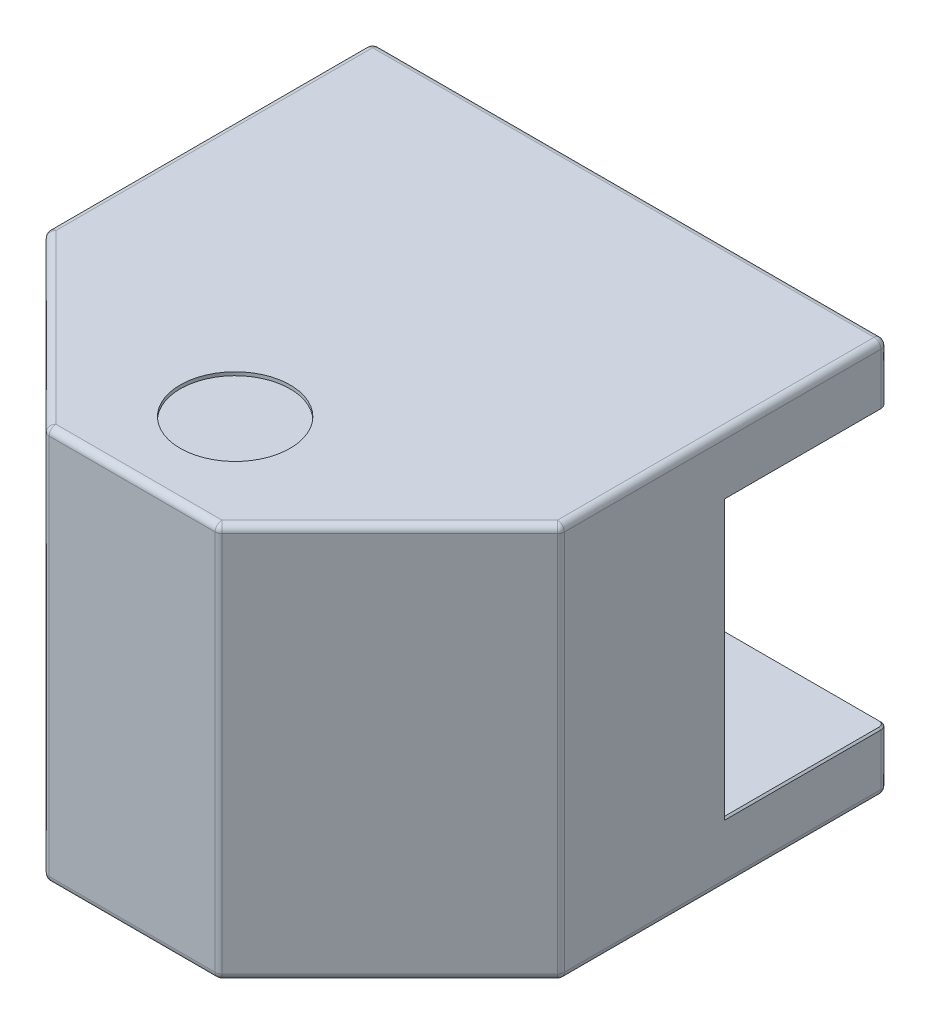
ISO-10303-21;
HEADER;
FILE_DESCRIPTION(('STEP AP214'),'2;1');
FILE_NAME('part.step','',(''),(''),'','','');
FILE_SCHEMA(('AUTOMOTIVE_DESIGN { 1 0 10303 214 1 1 1 1 }'));
ENDSEC;
DATA;
#1=APPLICATION_CONTEXT('core data for automotive mechanical design processes');
#2=APPLICATION_PROTOCOL_DEFINITION('international standard','automotive_design',2000,#1);
#3=PRODUCT_CONTEXT('',#1,'mechanical');
#4=PRODUCT('Part','Part','',(#3));
#5=PRODUCT_RELATED_PRODUCT_CATEGORY('part','',(#4));
#6=PRODUCT_DEFINITION_FORMATION('','',#4);
#7=PRODUCT_DEFINITION_CONTEXT('part definition',#1,'design');
#8=PRODUCT_DEFINITION('design','',#6,#7);
#9=PRODUCT_DEFINITION_SHAPE('','',#8);
#10=(LENGTH_UNIT() NAMED_UNIT(*) SI_UNIT(.MILLI.,.METRE.));
#11=(NAMED_UNIT(*) PLANE_ANGLE_UNIT() SI_UNIT($,.RADIAN.));
#12=(NAMED_UNIT(*) SI_UNIT($,.STERADIAN.) SOLID_ANGLE_UNIT());
#13=UNCERTAINTY_MEASURE_WITH_UNIT(LENGTH_MEASURE(1.E-05),#10,'distance_accuracy_value','');
#14=(GEOMETRIC_REPRESENTATION_CONTEXT(3) GLOBAL_UNCERTAINTY_ASSIGNED_CONTEXT((#13)) GLOBAL_UNIT_ASSIGNED_CONTEXT((#10,
#11,#12)) REPRESENTATION_CONTEXT('',''));
#15=CARTESIAN_POINT('',(0.,0.,0.));
#16=DIRECTION('',(0.,0.,1.));
#17=DIRECTION('',(1.,0.,0.));
#18=AXIS2_PLACEMENT_3D('',#15,#16,#17);
#19=CARTESIAN_POINT('',(0.,115.,0.));
#20=DIRECTION('',(0.,0.,1.));
#21=DIRECTION('',(1.,0.,0.));
#22=AXIS2_PLACEMENT_3D('',#19,#20,#21);
#23=PLANE('',#22);
#24=DIRECTION('',(0.,-1.,0.));
#25=VECTOR('',#24,1.);
#26=CARTESIAN_POINT('',(148.,115.,0.));
#27=LINE('',#26,#25);
#28=CARTESIAN_POINT('',(148.,113.,0.));
#29=VERTEX_POINT('',#28);
#30=CARTESIAN_POINT('',(148.,98.,0.));
#31=VERTEX_POINT('',#30);
#32=EDGE_CURVE('E360',#29,#31,#27,.T.);
#33=ORIENTED_EDGE('',*,*,#32,.T.);
#34=DIRECTION('',(-1.,0.,0.));
#35=VECTOR('',#34,1.);
#36=CARTESIAN_POINT('',(0.,97.9999999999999,0.));
#37=LINE('',#36,#35);
#38=CARTESIAN_POINT('',(2.,98.,0.));
#39=VERTEX_POINT('',#38);
#40=EDGE_CURVE('E468',#31,#39,#37,.T.);
#41=ORIENTED_EDGE('',*,*,#40,.T.);
#42=DIRECTION('',(0.,-1.,0.));
#43=VECTOR('',#42,1.);
#44=CARTESIAN_POINT('',(2.,115.,0.));
#45=LINE('',#44,#43);
#46=CARTESIAN_POINT('',(2.,113.,0.));
#47=VERTEX_POINT('',#46);
#48=EDGE_CURVE('E365',#39,#47,#45,.F.);
#49=ORIENTED_EDGE('',*,*,#48,.T.);
#50=DIRECTION('',(-1.,0.,0.));
#51=VECTOR('',#50,1.);
#52=CARTESIAN_POINT('',(0.,113.,0.));
#53=LINE('',#52,#51);
#54=EDGE_CURVE('E363',#47,#29,#53,.F.);
#55=ORIENTED_EDGE('',*,*,#54,.T.);
#56=EDGE_LOOP('',(#33,#41,#49,#55));
#57=FACE_BOUND('',#56,.T.);
#58=ADVANCED_FACE('F43',(#57),#23,.F.);
#59=CARTESIAN_POINT('',(0.,115.,95.));
#60=DIRECTION('',(1.,0.,0.));
#61=DIRECTION('',(0.,0.,-1.));
#62=AXIS2_PLACEMENT_3D('',#59,#60,#61);
#63=PLANE('',#62);
#64=DIRECTION('',(0.,-1.,0.));
#65=VECTOR('',#64,1.);
#66=CARTESIAN_POINT('',(0.,115.,2.));
#67=LINE('',#66,#65);
#68=CARTESIAN_POINT('',(0.,113.,2.));
#69=VERTEX_POINT('',#68);
#70=CARTESIAN_POINT('',(0.,98.,2.));
#71=VERTEX_POINT('',#70);
#72=EDGE_CURVE('E325',#69,#71,#67,.T.);
#73=ORIENTED_EDGE('',*,*,#72,.T.);
#74=DIRECTION('',(0.,0.,1.));
#75=VECTOR('',#74,1.);
#76=CARTESIAN_POINT('',(0.,98.,95.));
#77=LINE('',#76,#75);
#78=CARTESIAN_POINT('',(0.,98.,47.5));
#79=VERTEX_POINT('',#78);
#80=EDGE_CURVE('E475',#71,#79,#77,.T.);
#81=ORIENTED_EDGE('',*,*,#80,.T.);
#82=DIRECTION('',(0.,-1.,0.));
#83=VECTOR('',#82,1.);
#84=CARTESIAN_POINT('',(0.,17.5,47.5));
#85=LINE('',#84,#83);
#86=CARTESIAN_POINT('',(0.,17.,47.5));
#87=VERTEX_POINT('',#86);
#88=EDGE_CURVE('E473',#79,#87,#85,.T.);
#89=ORIENTED_EDGE('',*,*,#88,.T.);
#90=DIRECTION('',(0.,0.,-1.));
#91=VECTOR('',#90,1.);
#92=CARTESIAN_POINT('',(0.,17.,95.));
#93=LINE('',#92,#91);
#94=CARTESIAN_POINT('',(0.,17.,2.));
#95=VERTEX_POINT('',#94);
#96=EDGE_CURVE('E471',#87,#95,#93,.T.);
#97=ORIENTED_EDGE('',*,*,#96,.T.);
#98=DIRECTION('',(0.,-1.,0.));
#99=VECTOR('',#98,1.);
#100=CARTESIAN_POINT('',(0.,115.,2.));
#101=LINE('',#100,#99);
#102=CARTESIAN_POINT('',(0.,2.,2.));
#103=VERTEX_POINT('',#102);
#104=EDGE_CURVE('E317',#95,#103,#101,.T.);
#105=ORIENTED_EDGE('',*,*,#104,.T.);
#106=DIRECTION('',(0.,0.,1.));
#107=VECTOR('',#106,1.);
#108=CARTESIAN_POINT('',(0.,2.,95.));
#109=LINE('',#108,#107);
#110=CARTESIAN_POINT('',(0.,2.,94.1715728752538));
#111=VERTEX_POINT('',#110);
#112=EDGE_CURVE('E319',#103,#111,#109,.T.);
#113=ORIENTED_EDGE('',*,*,#112,.T.);
#114=DIRECTION('',(0.,-1.,0.));
#115=VECTOR('',#114,1.);
#116=CARTESIAN_POINT('',(0.,115.,94.1715728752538));
#117=LINE('',#116,#115);
#118=CARTESIAN_POINT('',(0.,113.,94.1715728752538));
#119=VERTEX_POINT('',#118);
#120=EDGE_CURVE('E321',#111,#119,#117,.F.);
#121=ORIENTED_EDGE('',*,*,#120,.T.);
#122=DIRECTION('',(0.,0.,1.));
#123=VECTOR('',#122,1.);
#124=CARTESIAN_POINT('',(0.,113.,95.));
#125=LINE('',#124,#123);
#126=EDGE_CURVE('E323',#119,#69,#125,.F.);
#127=ORIENTED_EDGE('',*,*,#126,.T.);
#128=EDGE_LOOP('',(#73,#81,#89,#97,#105,#113,#121,#127));
#129=FACE_BOUND('',#128,.T.);
#130=ADVANCED_FACE('F584',(#129),#63,.F.);
#131=CARTESIAN_POINT('',(49.9999999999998,115.,145.));
#132=DIRECTION('',(0.707106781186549,0.,-0.707106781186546));
#133=DIRECTION('',(-0.707106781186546,0.,-0.707106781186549));
#134=AXIS2_PLACEMENT_3D('',#131,#132,#133);
#135=PLANE('',#134);
#136=DIRECTION('',(0.,-1.,0.));
#137=VECTOR('',#136,1.);
#138=CARTESIAN_POINT('',(0.585786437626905,115.,95.5857864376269));
#139=LINE('',#138,#137);
#140=CARTESIAN_POINT('',(0.585786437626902,113.,95.5857864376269));
#141=VERTEX_POINT('',#140);
#142=CARTESIAN_POINT('',(0.585786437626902,2.,95.5857864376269));
#143=VERTEX_POINT('',#142);
#144=EDGE_CURVE('E312',#141,#143,#139,.T.);
#145=ORIENTED_EDGE('',*,*,#144,.T.);
#146=DIRECTION('',(0.707106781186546,0.,0.707106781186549));
#147=VECTOR('',#146,1.);
#148=CARTESIAN_POINT('',(49.9999999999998,2.,145.));
#149=LINE('',#148,#147);
#150=CARTESIAN_POINT('',(49.4142135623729,2.,144.414213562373));
#151=VERTEX_POINT('',#150);
#152=EDGE_CURVE('E315',#143,#151,#149,.T.);
#153=ORIENTED_EDGE('',*,*,#152,.T.);
#154=DIRECTION('',(0.,-1.,0.));
#155=VECTOR('',#154,1.);
#156=CARTESIAN_POINT('',(49.4142135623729,115.,144.414213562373));
#157=LINE('',#156,#155);
#158=CARTESIAN_POINT('',(49.4142135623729,113.,144.414213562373));
#159=VERTEX_POINT('',#158);
#160=EDGE_CURVE('E310',#151,#159,#157,.F.);
#161=ORIENTED_EDGE('',*,*,#160,.T.);
#162=DIRECTION('',(0.707106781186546,0.,0.707106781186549));
#163=VECTOR('',#162,1.);
#164=CARTESIAN_POINT('',(49.9999999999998,113.,145.));
#165=LINE('',#164,#163);
#166=EDGE_CURVE('E308',#159,#141,#165,.F.);
#167=ORIENTED_EDGE('',*,*,#166,.T.);
#168=EDGE_LOOP('',(#145,#153,#161,#167));
#169=FACE_BOUND('',#168,.T.);
#170=ADVANCED_FACE('F711',(#169),#135,.F.);
#171=CARTESIAN_POINT('',(100.,115.,145.));
#172=DIRECTION('',(0.,0.,-1.));
#173=DIRECTION('',(-1.,0.,0.));
#174=AXIS2_PLACEMENT_3D('',#171,#172,#173);
#175=PLANE('',#174);
#176=DIRECTION('',(0.,-1.,0.));
#177=VECTOR('',#176,1.);
#178=CARTESIAN_POINT('',(50.828427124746,115.,145.));
#179=LINE('',#178,#177);
#180=CARTESIAN_POINT('',(50.828427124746,113.,145.));
#181=VERTEX_POINT('',#180);
#182=CARTESIAN_POINT('',(50.828427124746,2.,145.));
#183=VERTEX_POINT('',#182);
#184=EDGE_CURVE('E291',#181,#183,#179,.T.);
#185=ORIENTED_EDGE('',*,*,#184,.T.);
#186=DIRECTION('',(1.,0.,0.));
#187=VECTOR('',#186,1.);
#188=CARTESIAN_POINT('',(100.,2.,145.));
#189=LINE('',#188,#187);
#190=CARTESIAN_POINT('',(99.171572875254,2.,145.));
#191=VERTEX_POINT('',#190);
#192=EDGE_CURVE('E296',#183,#191,#189,.T.);
#193=ORIENTED_EDGE('',*,*,#192,.T.);
#194=DIRECTION('',(0.,-1.,0.));
#195=VECTOR('',#194,1.);
#196=CARTESIAN_POINT('',(99.171572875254,115.,145.));
#197=LINE('',#196,#195);
#198=CARTESIAN_POINT('',(99.171572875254,113.,145.));
#199=VERTEX_POINT('',#198);
#200=EDGE_CURVE('E293',#191,#199,#197,.F.);
#201=ORIENTED_EDGE('',*,*,#200,.T.);
#202=DIRECTION('',(1.,0.,0.));
#203=VECTOR('',#202,1.);
#204=CARTESIAN_POINT('',(100.,113.,145.));
#205=LINE('',#204,#203);
#206=EDGE_CURVE('E289',#199,#181,#205,.F.);
#207=ORIENTED_EDGE('',*,*,#206,.T.);
#208=EDGE_LOOP('',(#185,#193,#201,#207));
#209=FACE_BOUND('',#208,.T.);
#210=ADVANCED_FACE('F723',(#209),#175,.F.);
#211=CARTESIAN_POINT('',(150.,115.,95.));
#212=DIRECTION('',(-0.707106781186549,0.,-0.707106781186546));
#213=DIRECTION('',(-0.707106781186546,0.,0.707106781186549));
#214=AXIS2_PLACEMENT_3D('',#211,#212,#213);
#215=PLANE('',#214);
#216=DIRECTION('',(0.,-1.,0.));
#217=VECTOR('',#216,1.);
#218=CARTESIAN_POINT('',(100.585786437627,115.,144.414213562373));
#219=LINE('',#218,#217);
#220=CARTESIAN_POINT('',(100.585786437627,113.,144.414213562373));
#221=VERTEX_POINT('',#220);
#222=CARTESIAN_POINT('',(100.585786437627,2.,144.414213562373));
#223=VERTEX_POINT('',#222);
#224=EDGE_CURVE('E253',#221,#223,#219,.T.);
#225=ORIENTED_EDGE('',*,*,#224,.T.);
#226=DIRECTION('',(0.707106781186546,0.,-0.707106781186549));
#227=VECTOR('',#226,1.);
#228=CARTESIAN_POINT('',(150.,2.,95.));
#229=LINE('',#228,#227);
#230=CARTESIAN_POINT('',(149.414213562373,2.,95.5857864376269));
#231=VERTEX_POINT('',#230);
#232=EDGE_CURVE('E249',#223,#231,#229,.T.);
#233=ORIENTED_EDGE('',*,*,#232,.T.);
#234=DIRECTION('',(0.,-1.,0.));
#235=VECTOR('',#234,1.);
#236=CARTESIAN_POINT('',(149.414213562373,115.,95.5857864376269));
#237=LINE('',#236,#235);
#238=CARTESIAN_POINT('',(149.414213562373,113.,95.5857864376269));
#239=VERTEX_POINT('',#238);
#240=EDGE_CURVE('E241',#231,#239,#237,.F.);
#241=ORIENTED_EDGE('',*,*,#240,.T.);
#242=DIRECTION('',(0.707106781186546,0.,-0.707106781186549));
#243=VECTOR('',#242,1.);
#244=CARTESIAN_POINT('',(150.,113.,95.));
#245=LINE('',#244,#243);
#246=EDGE_CURVE('E246',#239,#221,#245,.F.);
#247=ORIENTED_EDGE('',*,*,#246,.T.);
#248=EDGE_LOOP('',(#225,#233,#241,#247));
#249=FACE_BOUND('',#248,.T.);
#250=ADVANCED_FACE('F244',(#249),#215,.F.);
#251=CARTESIAN_POINT('',(150.,115.,0.));
#252=DIRECTION('',(-1.,0.,0.));
#253=DIRECTION('',(0.,0.,1.));
#254=AXIS2_PLACEMENT_3D('',#251,#252,#253);
#255=PLANE('',#254);
#256=DIRECTION('',(0.,1.,0.));
#257=VECTOR('',#256,1.);
#258=CARTESIAN_POINT('',(150.,97.5,47.5));
#259=LINE('',#258,#257);
#260=CARTESIAN_POINT('',(150.,17.,47.5));
#261=VERTEX_POINT('',#260);
#262=CARTESIAN_POINT('',(150.,98.,47.5));
#263=VERTEX_POINT('',#262);
#264=EDGE_CURVE('E497',#261,#263,#259,.T.);
#265=ORIENTED_EDGE('',*,*,#264,.T.);
#266=DIRECTION('',(0.,0.,-1.));
#267=VECTOR('',#266,1.);
#268=CARTESIAN_POINT('',(150.,98.,0.));
#269=LINE('',#268,#267);
#270=CARTESIAN_POINT('',(150.,98.,2.));
#271=VERTEX_POINT('',#270);
#272=EDGE_CURVE('E499',#263,#271,#269,.T.);
#273=ORIENTED_EDGE('',*,*,#272,.T.);
#274=DIRECTION('',(0.,-1.,0.));
#275=VECTOR('',#274,1.);
#276=CARTESIAN_POINT('',(150.,115.,2.));
#277=LINE('',#276,#275);
#278=CARTESIAN_POINT('',(150.,113.,2.));
#279=VERTEX_POINT('',#278);
#280=EDGE_CURVE('E298',#271,#279,#277,.F.);
#281=ORIENTED_EDGE('',*,*,#280,.T.);
#282=DIRECTION('',(0.,0.,-1.));
#283=VECTOR('',#282,1.);
#284=CARTESIAN_POINT('',(150.,113.,0.));
#285=LINE('',#284,#283);
#286=CARTESIAN_POINT('',(150.,113.,94.1715728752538));
#287=VERTEX_POINT('',#286);
#288=EDGE_CURVE('E300',#279,#287,#285,.F.);
#289=ORIENTED_EDGE('',*,*,#288,.T.);
#290=DIRECTION('',(0.,-1.,0.));
#291=VECTOR('',#290,1.);
#292=CARTESIAN_POINT('',(150.,115.,94.1715728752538));
#293=LINE('',#292,#291);
#294=CARTESIAN_POINT('',(150.,2.,94.1715728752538));
#295=VERTEX_POINT('',#294);
#296=EDGE_CURVE('E261',#287,#295,#293,.T.);
#297=ORIENTED_EDGE('',*,*,#296,.T.);
#298=DIRECTION('',(0.,0.,-1.));
#299=VECTOR('',#298,1.);
#300=CARTESIAN_POINT('',(150.,2.,0.));
#301=LINE('',#300,#299);
#302=CARTESIAN_POINT('',(150.,2.,2.));
#303=VERTEX_POINT('',#302);
#304=EDGE_CURVE('E303',#295,#303,#301,.T.);
#305=ORIENTED_EDGE('',*,*,#304,.T.);
#306=DIRECTION('',(0.,-1.,0.));
#307=VECTOR('',#306,1.);
#308=CARTESIAN_POINT('',(150.,115.,2.));
#309=LINE('',#308,#307);
#310=CARTESIAN_POINT('',(150.,17.,2.));
#311=VERTEX_POINT('',#310);
#312=EDGE_CURVE('E305',#303,#311,#309,.F.);
#313=ORIENTED_EDGE('',*,*,#312,.T.);
#314=DIRECTION('',(0.,0.,1.));
#315=VECTOR('',#314,1.);
#316=CARTESIAN_POINT('',(150.,17.,0.));
#317=LINE('',#316,#315);
#318=EDGE_CURVE('E495',#311,#261,#317,.T.);
#319=ORIENTED_EDGE('',*,*,#318,.T.);
#320=EDGE_LOOP('',(#265,#273,#281,#289,#297,#305,#313,#319));
#321=FACE_BOUND('',#320,.T.);
#322=ADVANCED_FACE('F554',(#321),#255,.F.);
#323=DIRECTION('',(0.,-1.,0.));
#324=VECTOR('',#323,1.);
#325=CARTESIAN_POINT('',(2.,115.,0.));
#326=LINE('',#325,#324);
#327=CARTESIAN_POINT('',(2.,2.,0.));
#328=VERTEX_POINT('',#327);
#329=CARTESIAN_POINT('',(2.,17.,0.));
#330=VERTEX_POINT('',#329);
#331=EDGE_CURVE('E345',#328,#330,#326,.F.);
#332=ORIENTED_EDGE('',*,*,#331,.T.);
#333=DIRECTION('',(1.,0.,0.));
#334=VECTOR('',#333,1.);
#335=CARTESIAN_POINT('',(0.,17.,0.));
#336=LINE('',#335,#334);
#337=CARTESIAN_POINT('',(148.,17.,0.));
#338=VERTEX_POINT('',#337);
#339=EDGE_CURVE('E11',#330,#338,#336,.T.);
#340=ORIENTED_EDGE('',*,*,#339,.T.);
#341=DIRECTION('',(0.,-1.,0.));
#342=VECTOR('',#341,1.);
#343=CARTESIAN_POINT('',(148.,115.,0.));
#344=LINE('',#343,#342);
#345=CARTESIAN_POINT('',(148.,2.,0.));
#346=VERTEX_POINT('',#345);
#347=EDGE_CURVE('E341',#338,#346,#344,.T.);
#348=ORIENTED_EDGE('',*,*,#347,.T.);
#349=DIRECTION('',(-1.,0.,0.));
#350=VECTOR('',#349,1.);
#351=CARTESIAN_POINT('',(0.,2.,0.));
#352=LINE('',#351,#350);
#353=EDGE_CURVE('E343',#346,#328,#352,.T.);
#354=ORIENTED_EDGE('',*,*,#353,.T.);
#355=EDGE_LOOP('',(#332,#340,#348,#354));
#356=FACE_BOUND('',#355,.T.);
#357=ADVANCED_FACE('F571',(#356),#23,.F.);
#358=CARTESIAN_POINT('',(0.,115.,0.));
#359=DIRECTION('',(0.,-1.,0.));
#360=DIRECTION('',(0.,0.,-1.));
#361=AXIS2_PLACEMENT_3D('',#358,#359,#360);
#362=PLANE('',#361);
#363=CARTESIAN_POINT('',(75.,115.,115.));
#364=DIRECTION('',(0.,1.,0.));
#365=DIRECTION('',(0.,0.,1.));
#366=AXIS2_PLACEMENT_3D('',#363,#364,#365);
#367=CIRCLE('',#366,16.);
#368=CARTESIAN_POINT('',(75.,115.,131.));
#369=VERTEX_POINT('',#368);
#370=EDGE_CURVE('E659',#369,#369,#367,.T.);
#371=ORIENTED_EDGE('',*,*,#370,.F.);
#372=EDGE_LOOP('',(#371));
#373=FACE_BOUND('',#372,.T.);
#374=DIRECTION('',(0.,0.,-1.));
#375=VECTOR('',#374,1.);
#376=CARTESIAN_POINT('',(148.,115.,0.));
#377=LINE('',#376,#375);
#378=CARTESIAN_POINT('',(148.,115.,94.1715728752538));
#379=VERTEX_POINT('',#378);
#380=CARTESIAN_POINT('',(148.,115.,2.));
#381=VERTEX_POINT('',#380);
#382=EDGE_CURVE('E355',#379,#381,#377,.T.);
#383=ORIENTED_EDGE('',*,*,#382,.T.);
#384=DIRECTION('',(-1.,0.,0.));
#385=VECTOR('',#384,1.);
#386=CARTESIAN_POINT('',(0.,115.,2.));
#387=LINE('',#386,#385);
#388=CARTESIAN_POINT('',(2.,115.,2.));
#389=VERTEX_POINT('',#388);
#390=EDGE_CURVE('E357',#381,#389,#387,.T.);
#391=ORIENTED_EDGE('',*,*,#390,.T.);
#392=DIRECTION('',(0.,0.,1.));
#393=VECTOR('',#392,1.);
#394=CARTESIAN_POINT('',(2.,115.,0.));
#395=LINE('',#394,#393);
#396=CARTESIAN_POINT('',(2.,115.,94.1715728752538));
#397=VERTEX_POINT('',#396);
#398=EDGE_CURVE('E347',#389,#397,#395,.T.);
#399=ORIENTED_EDGE('',*,*,#398,.T.);
#400=DIRECTION('',(0.707106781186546,0.,0.707106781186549));
#401=VECTOR('',#400,1.);
#402=CARTESIAN_POINT('',(-46.0857864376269,115.,46.0857864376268));
#403=LINE('',#402,#401);
#404=CARTESIAN_POINT('',(50.828427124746,115.,143.));
#405=VERTEX_POINT('',#404);
#406=EDGE_CURVE('E349',#397,#405,#403,.T.);
#407=ORIENTED_EDGE('',*,*,#406,.T.);
#408=DIRECTION('',(1.,0.,0.));
#409=VECTOR('',#408,1.);
#410=CARTESIAN_POINT('',(0.,115.,143.));
#411=LINE('',#410,#409);
#412=CARTESIAN_POINT('',(99.171572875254,115.,143.));
#413=VERTEX_POINT('',#412);
#414=EDGE_CURVE('E351',#405,#413,#411,.T.);
#415=ORIENTED_EDGE('',*,*,#414,.T.);
#416=DIRECTION('',(0.707106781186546,0.,-0.707106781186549));
#417=VECTOR('',#416,1.);
#418=CARTESIAN_POINT('',(121.085786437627,115.,121.085786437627));
#419=LINE('',#418,#417);
#420=EDGE_CURVE('E353',#413,#379,#419,.T.);
#421=ORIENTED_EDGE('',*,*,#420,.T.);
#422=EDGE_LOOP('',(#383,#391,#399,#407,#415,#421));
#423=FACE_BOUND('',#422,.T.);
#424=ADVANCED_FACE('F673',(#373,#423),#362,.F.);
#425=CARTESIAN_POINT('',(0.,0.,0.));
#426=DIRECTION('',(0.,-1.,0.));
#427=DIRECTION('',(0.,0.,-1.));
#428=AXIS2_PLACEMENT_3D('',#425,#426,#427);
#429=PLANE('',#428);
#430=DIRECTION('',(1.,0.,0.));
#431=VECTOR('',#430,1.);
#432=CARTESIAN_POINT('',(49.9999999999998,0.,143.));
#433=LINE('',#432,#431);
#434=CARTESIAN_POINT('',(99.171572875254,0.,143.));
#435=VERTEX_POINT('',#434);
#436=CARTESIAN_POINT('',(50.828427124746,0.,143.));
#437=VERTEX_POINT('',#436);
#438=EDGE_CURVE('E336',#435,#437,#433,.F.);
#439=ORIENTED_EDGE('',*,*,#438,.T.);
#440=DIRECTION('',(0.707106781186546,0.,0.707106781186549));
#441=VECTOR('',#440,1.);
#442=CARTESIAN_POINT('',(1.4142135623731,0.,93.5857864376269));
#443=LINE('',#442,#441);
#444=CARTESIAN_POINT('',(2.,0.,94.1715728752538));
#445=VERTEX_POINT('',#444);
#446=EDGE_CURVE('E338',#437,#445,#443,.F.);
#447=ORIENTED_EDGE('',*,*,#446,.T.);
#448=DIRECTION('',(0.,0.,1.));
#449=VECTOR('',#448,1.);
#450=CARTESIAN_POINT('',(2.,0.,0.));
#451=LINE('',#450,#449);
#452=CARTESIAN_POINT('',(2.,0.,2.));
#453=VERTEX_POINT('',#452);
#454=EDGE_CURVE('E328',#445,#453,#451,.F.);
#455=ORIENTED_EDGE('',*,*,#454,.T.);
#456=DIRECTION('',(-1.,0.,0.));
#457=VECTOR('',#456,1.);
#458=CARTESIAN_POINT('',(150.,0.,2.));
#459=LINE('',#458,#457);
#460=CARTESIAN_POINT('',(148.,0.,2.));
#461=VERTEX_POINT('',#460);
#462=EDGE_CURVE('E330',#453,#461,#459,.F.);
#463=ORIENTED_EDGE('',*,*,#462,.T.);
#464=DIRECTION('',(0.,0.,-1.));
#465=VECTOR('',#464,1.);
#466=CARTESIAN_POINT('',(148.,0.,95.));
#467=LINE('',#466,#465);
#468=CARTESIAN_POINT('',(148.,0.,94.1715728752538));
#469=VERTEX_POINT('',#468);
#470=EDGE_CURVE('E332',#461,#469,#467,.F.);
#471=ORIENTED_EDGE('',*,*,#470,.T.);
#472=DIRECTION('',(0.707106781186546,0.,-0.707106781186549));
#473=VECTOR('',#472,1.);
#474=CARTESIAN_POINT('',(98.5857864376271,0.,143.585786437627));
#475=LINE('',#474,#473);
#476=EDGE_CURVE('E334',#469,#435,#475,.F.);
#477=ORIENTED_EDGE('',*,*,#476,.T.);
#478=EDGE_LOOP('',(#439,#447,#455,#463,#471,#477));
#479=FACE_BOUND('',#478,.T.);
#480=ADVANCED_FACE('F676',(#479),#429,.T.);
#481=CARTESIAN_POINT('',(150.,97.5,47.));
#482=DIRECTION('',(0.,1.,0.));
#483=DIRECTION('',(0.,0.,1.));
#484=AXIS2_PLACEMENT_3D('',#481,#482,#483);
#485=PLANE('',#484);
#486=DIRECTION('',(1.,0.,0.));
#487=VECTOR('',#486,1.);
#488=CARTESIAN_POINT('',(150.,97.5,47.));
#489=LINE('',#488,#487);
#490=CARTESIAN_POINT('',(0.500000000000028,97.5,47.));
#491=VERTEX_POINT('',#490);
#492=CARTESIAN_POINT('',(149.5,97.5,47.));
#493=VERTEX_POINT('',#492);
#494=EDGE_CURVE('E280',#491,#493,#489,.T.);
#495=ORIENTED_EDGE('',*,*,#494,.F.);
#496=DIRECTION('',(0.,0.,-1.));
#497=VECTOR('',#496,1.);
#498=CARTESIAN_POINT('',(0.500000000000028,97.5,47.));
#499=LINE('',#498,#497);
#500=CARTESIAN_POINT('',(0.5,97.5,2.));
#501=VERTEX_POINT('',#500);
#502=EDGE_CURVE('E466',#491,#501,#499,.T.);
#503=ORIENTED_EDGE('',*,*,#502,.T.);
#504=CARTESIAN_POINT('',(2.,97.5,2.));
#505=DIRECTION('',(0.,1.,0.));
#506=DIRECTION('',(0.,0.,1.));
#507=AXIS2_PLACEMENT_3D('',#504,#505,#506);
#508=CIRCLE('',#507,1.5);
#509=CARTESIAN_POINT('',(2.,97.5,0.499999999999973));
#510=VERTEX_POINT('',#509);
#511=EDGE_CURVE('E464',#501,#510,#508,.F.);
#512=ORIENTED_EDGE('',*,*,#511,.T.);
#513=DIRECTION('',(1.,0.,0.));
#514=VECTOR('',#513,1.);
#515=CARTESIAN_POINT('',(150.,97.5,0.499999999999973));
#516=LINE('',#515,#514);
#517=CARTESIAN_POINT('',(148.,97.5,0.499999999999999));
#518=VERTEX_POINT('',#517);
#519=EDGE_CURVE('E461',#510,#518,#516,.T.);
#520=ORIENTED_EDGE('',*,*,#519,.T.);
#521=CARTESIAN_POINT('',(148.,97.5,2.));
#522=DIRECTION('',(0.,1.,0.));
#523=DIRECTION('',(0.,0.,1.));
#524=AXIS2_PLACEMENT_3D('',#521,#522,#523);
#525=CIRCLE('',#524,1.5);
#526=CARTESIAN_POINT('',(149.5,97.5,2.));
#527=VERTEX_POINT('',#526);
#528=EDGE_CURVE('E459',#518,#527,#525,.F.);
#529=ORIENTED_EDGE('',*,*,#528,.T.);
#530=DIRECTION('',(0.,0.,1.));
#531=VECTOR('',#530,1.);
#532=CARTESIAN_POINT('',(149.5,97.5,47.));
#533=LINE('',#532,#531);
#534=EDGE_CURVE('E367',#527,#493,#533,.T.);
#535=ORIENTED_EDGE('',*,*,#534,.T.);
#536=EDGE_LOOP('',(#495,#503,#512,#520,#529,#535));
#537=FACE_BOUND('',#536,.T.);
#538=ADVANCED_FACE('F691',(#537),#485,.F.);
#539=CARTESIAN_POINT('',(150.,17.5,47.));
#540=DIRECTION('',(0.,-1.,0.));
#541=DIRECTION('',(0.,0.,-1.));
#542=AXIS2_PLACEMENT_3D('',#539,#540,#541);
#543=PLANE('',#542);
#544=CARTESIAN_POINT('',(2.,17.5,2.));
#545=DIRECTION('',(0.,-1.,0.));
#546=DIRECTION('',(0.,0.,-1.));
#547=AXIS2_PLACEMENT_3D('',#544,#545,#546);
#548=CIRCLE('',#547,1.49999999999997);
#549=CARTESIAN_POINT('',(2.,17.5,0.500000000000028));
#550=VERTEX_POINT('',#549);
#551=CARTESIAN_POINT('',(0.500000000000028,17.5,2.));
#552=VERTEX_POINT('',#551);
#553=EDGE_CURVE('E483',#550,#552,#548,.F.);
#554=ORIENTED_EDGE('',*,*,#553,.T.);
#555=DIRECTION('',(0.,0.,1.));
#556=VECTOR('',#555,1.);
#557=CARTESIAN_POINT('',(0.500000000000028,17.5,47.));
#558=LINE('',#557,#556);
#559=CARTESIAN_POINT('',(0.500000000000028,17.5,47.));
#560=VERTEX_POINT('',#559);
#561=EDGE_CURVE('E489',#552,#560,#558,.T.);
#562=ORIENTED_EDGE('',*,*,#561,.T.);
#563=DIRECTION('',(-1.,0.,0.));
#564=VECTOR('',#563,1.);
#565=CARTESIAN_POINT('',(150.,17.5,47.));
#566=LINE('',#565,#564);
#567=CARTESIAN_POINT('',(149.5,17.5,47.));
#568=VERTEX_POINT('',#567);
#569=EDGE_CURVE('E283',#568,#560,#566,.T.);
#570=ORIENTED_EDGE('',*,*,#569,.F.);
#571=DIRECTION('',(0.,0.,-1.));
#572=VECTOR('',#571,1.);
#573=CARTESIAN_POINT('',(149.5,17.5,47.));
#574=LINE('',#573,#572);
#575=CARTESIAN_POINT('',(149.5,17.5,2.));
#576=VERTEX_POINT('',#575);
#577=EDGE_CURVE('E487',#568,#576,#574,.T.);
#578=ORIENTED_EDGE('',*,*,#577,.T.);
#579=CARTESIAN_POINT('',(148.,17.5,2.));
#580=DIRECTION('',(0.,-1.,0.));
#581=DIRECTION('',(0.,0.,-1.));
#582=AXIS2_PLACEMENT_3D('',#579,#580,#581);
#583=CIRCLE('',#582,1.49999999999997);
#584=CARTESIAN_POINT('',(148.,17.5,0.500000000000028));
#585=VERTEX_POINT('',#584);
#586=EDGE_CURVE('E485',#576,#585,#583,.F.);
#587=ORIENTED_EDGE('',*,*,#586,.T.);
#588=DIRECTION('',(-1.,0.,0.));
#589=VECTOR('',#588,1.);
#590=CARTESIAN_POINT('',(150.,17.5,0.500000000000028));
#591=LINE('',#590,#589);
#592=EDGE_CURVE('E481',#585,#550,#591,.T.);
#593=ORIENTED_EDGE('',*,*,#592,.T.);
#594=EDGE_LOOP('',(#554,#562,#570,#578,#587,#593));
#595=FACE_BOUND('',#594,.T.);
#596=ADVANCED_FACE('F652',(#595),#543,.F.);
#597=CARTESIAN_POINT('',(0.,0.,47.));
#598=DIRECTION('',(0.,0.,-1.));
#599=DIRECTION('',(-1.,0.,0.));
#600=AXIS2_PLACEMENT_3D('',#597,#598,#599);
#601=PLANE('',#600);
#602=ORIENTED_EDGE('',*,*,#569,.T.);
#603=DIRECTION('',(0.,1.,0.));
#604=VECTOR('',#603,1.);
#605=CARTESIAN_POINT('',(0.500000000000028,97.5,47.));
#606=LINE('',#605,#604);
#607=EDGE_CURVE('E479',#560,#491,#606,.T.);
#608=ORIENTED_EDGE('',*,*,#607,.T.);
#609=ORIENTED_EDGE('',*,*,#494,.T.);
#610=DIRECTION('',(0.,-1.,0.));
#611=VECTOR('',#610,1.);
#612=CARTESIAN_POINT('',(149.5,17.5,47.));
#613=LINE('',#612,#611);
#614=EDGE_CURVE('E477',#493,#568,#613,.T.);
#615=ORIENTED_EDGE('',*,*,#614,.T.);
#616=EDGE_LOOP('',(#602,#608,#609,#615));
#617=FACE_BOUND('',#616,.T.);
#618=ADVANCED_FACE('F655',(#617),#601,.T.);
#619=CARTESIAN_POINT('',(2.,115.,2.));
#620=DIRECTION('',(0.,-1.,0.));
#621=DIRECTION('',(0.,0.,-1.));
#622=AXIS2_PLACEMENT_3D('',#619,#620,#621);
#623=CYLINDRICAL_SURFACE('',#622,2.);
#624=ORIENTED_EDGE('',*,*,#48,.F.);
#625=CARTESIAN_POINT('',(2.,98.,2.));
#626=DIRECTION('',(0.,1.,0.));
#627=DIRECTION('',(0.,0.,1.));
#628=AXIS2_PLACEMENT_3D('',#625,#626,#627);
#629=CIRCLE('',#628,2.);
#630=EDGE_CURVE('E491',#39,#71,#629,.T.);
#631=ORIENTED_EDGE('',*,*,#630,.T.);
#632=ORIENTED_EDGE('',*,*,#72,.F.);
#633=CARTESIAN_POINT('',(2.,113.,2.));
#634=DIRECTION('',(0.,1.,0.));
#635=DIRECTION('',(0.,0.,1.));
#636=AXIS2_PLACEMENT_3D('',#633,#634,#635);
#637=CIRCLE('',#636,2.);
#638=EDGE_CURVE('E455',#47,#69,#637,.T.);
#639=ORIENTED_EDGE('',*,*,#638,.F.);
#640=EDGE_LOOP('',(#624,#631,#632,#639));
#641=FACE_BOUND('',#640,.T.);
#642=ADVANCED_FACE('F604',(#641),#623,.T.);
#643=CARTESIAN_POINT('',(2.,115.,2.));
#644=DIRECTION('',(0.,-1.,0.));
#645=DIRECTION('',(0.,0.,-1.));
#646=AXIS2_PLACEMENT_3D('',#643,#644,#645);
#647=CYLINDRICAL_SURFACE('',#646,2.);
#648=ORIENTED_EDGE('',*,*,#104,.F.);
#649=CARTESIAN_POINT('',(2.,17.,2.));
#650=DIRECTION('',(0.,-1.,0.));
#651=DIRECTION('',(0.,0.,-1.));
#652=AXIS2_PLACEMENT_3D('',#649,#650,#651);
#653=CIRCLE('',#652,2.);
#654=EDGE_CURVE('E53',#95,#330,#653,.T.);
#655=ORIENTED_EDGE('',*,*,#654,.T.);
#656=ORIENTED_EDGE('',*,*,#331,.F.);
#657=CARTESIAN_POINT('',(2.,2.,2.));
#658=DIRECTION('',(0.,-1.,0.));
#659=DIRECTION('',(0.,0.,-1.));
#660=AXIS2_PLACEMENT_3D('',#657,#658,#659);
#661=CIRCLE('',#660,2.);
#662=EDGE_CURVE('E452',#103,#328,#661,.T.);
#663=ORIENTED_EDGE('',*,*,#662,.F.);
#664=EDGE_LOOP('',(#648,#655,#656,#663));
#665=FACE_BOUND('',#664,.T.);
#666=ADVANCED_FACE('F573',(#665),#647,.T.);
#667=CARTESIAN_POINT('',(2.,113.,2.));
#668=DIRECTION('',(-1.,0.,0.));
#669=DIRECTION('',(0.,0.,1.));
#670=AXIS2_PLACEMENT_3D('',#667,#668,#669);
#671=SPHERICAL_SURFACE('',#670,2.);
#672=CARTESIAN_POINT('',(2.,113.,2.));
#673=DIRECTION('',(-1.,0.,0.));
#674=DIRECTION('',(0.,0.,1.));
#675=AXIS2_PLACEMENT_3D('',#672,#673,#674);
#676=CIRCLE('',#675,2.);
#677=EDGE_CURVE('E446',#47,#389,#676,.F.);
#678=ORIENTED_EDGE('',*,*,#677,.F.);
#679=ORIENTED_EDGE('',*,*,#638,.T.);
#680=CARTESIAN_POINT('',(2.,113.,2.));
#681=DIRECTION('',(0.,0.,-1.));
#682=DIRECTION('',(0.,1.,0.));
#683=AXIS2_PLACEMENT_3D('',#680,#681,#682);
#684=CIRCLE('',#683,2.);
#685=EDGE_CURVE('E449',#389,#69,#684,.F.);
#686=ORIENTED_EDGE('',*,*,#685,.F.);
#687=EDGE_LOOP('',(#678,#679,#686));
#688=FACE_BOUND('',#687,.T.);
#689=ADVANCED_FACE('F608',(#688),#671,.T.);
#690=CARTESIAN_POINT('',(2.,2.,2.));
#691=DIRECTION('',(0.,0.,-1.));
#692=DIRECTION('',(0.,1.,0.));
#693=AXIS2_PLACEMENT_3D('',#690,#691,#692);
#694=SPHERICAL_SURFACE('',#693,2.);
#695=CARTESIAN_POINT('',(2.,2.,2.));
#696=DIRECTION('',(0.,0.,-1.));
#697=DIRECTION('',(-1.,0.,0.));
#698=AXIS2_PLACEMENT_3D('',#695,#696,#697);
#699=CIRCLE('',#698,2.);
#700=EDGE_CURVE('E440',#103,#453,#699,.F.);
#701=ORIENTED_EDGE('',*,*,#700,.F.);
#702=ORIENTED_EDGE('',*,*,#662,.T.);
#703=CARTESIAN_POINT('',(2.,2.,2.));
#704=DIRECTION('',(-1.,0.,0.));
#705=DIRECTION('',(0.,0.,1.));
#706=AXIS2_PLACEMENT_3D('',#703,#704,#705);
#707=CIRCLE('',#706,2.);
#708=EDGE_CURVE('E443',#453,#328,#707,.F.);
#709=ORIENTED_EDGE('',*,*,#708,.F.);
#710=EDGE_LOOP('',(#701,#702,#709));
#711=FACE_BOUND('',#710,.T.);
#712=ADVANCED_FACE('F576',(#711),#694,.T.);
#713=CARTESIAN_POINT('',(2.,113.,0.));
#714=DIRECTION('',(0.,0.,1.));
#715=DIRECTION('',(1.,0.,0.));
#716=AXIS2_PLACEMENT_3D('',#713,#714,#715);
#717=CYLINDRICAL_SURFACE('',#716,2.);
#718=ORIENTED_EDGE('',*,*,#685,.T.);
#719=ORIENTED_EDGE('',*,*,#126,.F.);
#720=CARTESIAN_POINT('',(2.,113.,94.1715728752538));
#721=DIRECTION('',(0.,0.,1.));
#722=DIRECTION('',(1.,0.,0.));
#723=AXIS2_PLACEMENT_3D('',#720,#721,#722);
#724=CIRCLE('',#723,2.);
#725=EDGE_CURVE('E434',#397,#119,#724,.T.);
#726=ORIENTED_EDGE('',*,*,#725,.F.);
#727=ORIENTED_EDGE('',*,*,#398,.F.);
#728=EDGE_LOOP('',(#718,#719,#726,#727));
#729=FACE_BOUND('',#728,.T.);
#730=ADVANCED_FACE('F597',(#729),#717,.T.);
#731=CARTESIAN_POINT('',(0.,113.,2.));
#732=DIRECTION('',(-1.,0.,0.));
#733=DIRECTION('',(0.,0.,1.));
#734=AXIS2_PLACEMENT_3D('',#731,#732,#733);
#735=CYLINDRICAL_SURFACE('',#734,2.);
#736=ORIENTED_EDGE('',*,*,#677,.T.);
#737=ORIENTED_EDGE('',*,*,#390,.F.);
#738=CARTESIAN_POINT('',(148.,113.,2.));
#739=DIRECTION('',(1.,0.,0.));
#740=DIRECTION('',(0.,0.,-1.));
#741=AXIS2_PLACEMENT_3D('',#738,#739,#740);
#742=CIRCLE('',#741,2.);
#743=EDGE_CURVE('E431',#29,#381,#742,.T.);
#744=ORIENTED_EDGE('',*,*,#743,.F.);
#745=ORIENTED_EDGE('',*,*,#54,.F.);
#746=EDGE_LOOP('',(#736,#737,#744,#745));
#747=FACE_BOUND('',#746,.T.);
#748=ADVANCED_FACE('F613',(#747),#735,.T.);
#749=CARTESIAN_POINT('',(148.,115.,2.));
#750=DIRECTION('',(0.,-1.,0.));
#751=DIRECTION('',(0.,0.,-1.));
#752=AXIS2_PLACEMENT_3D('',#749,#750,#751);
#753=CYLINDRICAL_SURFACE('',#752,2.);
#754=ORIENTED_EDGE('',*,*,#280,.F.);
#755=CARTESIAN_POINT('',(148.,98.,2.));
#756=DIRECTION('',(0.,1.,0.));
#757=DIRECTION('',(0.,0.,1.));
#758=AXIS2_PLACEMENT_3D('',#755,#756,#757);
#759=CIRCLE('',#758,2.);
#760=EDGE_CURVE('E493',#271,#31,#759,.T.);
#761=ORIENTED_EDGE('',*,*,#760,.T.);
#762=ORIENTED_EDGE('',*,*,#32,.F.);
#763=CARTESIAN_POINT('',(148.,113.,2.));
#764=DIRECTION('',(0.,1.,0.));
#765=DIRECTION('',(0.,0.,1.));
#766=AXIS2_PLACEMENT_3D('',#763,#764,#765);
#767=CIRCLE('',#766,2.);
#768=EDGE_CURVE('E428',#279,#29,#767,.T.);
#769=ORIENTED_EDGE('',*,*,#768,.F.);
#770=EDGE_LOOP('',(#754,#761,#762,#769));
#771=FACE_BOUND('',#770,.T.);
#772=ADVANCED_FACE('F620',(#771),#753,.T.);
#773=CARTESIAN_POINT('',(148.,115.,2.));
#774=DIRECTION('',(0.,-1.,0.));
#775=DIRECTION('',(0.,0.,-1.));
#776=AXIS2_PLACEMENT_3D('',#773,#774,#775);
#777=CYLINDRICAL_SURFACE('',#776,2.);
#778=ORIENTED_EDGE('',*,*,#347,.F.);
#779=CARTESIAN_POINT('',(148.,17.,2.));
#780=DIRECTION('',(0.,-1.,0.));
#781=DIRECTION('',(0.,0.,-1.));
#782=AXIS2_PLACEMENT_3D('',#779,#780,#781);
#783=CIRCLE('',#782,2.);
#784=EDGE_CURVE('E501',#338,#311,#783,.T.);
#785=ORIENTED_EDGE('',*,*,#784,.T.);
#786=ORIENTED_EDGE('',*,*,#312,.F.);
#787=CARTESIAN_POINT('',(148.,2.,2.));
#788=DIRECTION('',(0.,-1.,0.));
#789=DIRECTION('',(0.,0.,-1.));
#790=AXIS2_PLACEMENT_3D('',#787,#788,#789);
#791=CIRCLE('',#790,2.);
#792=EDGE_CURVE('E425',#346,#303,#791,.T.);
#793=ORIENTED_EDGE('',*,*,#792,.F.);
#794=EDGE_LOOP('',(#778,#785,#786,#793));
#795=FACE_BOUND('',#794,.T.);
#796=ADVANCED_FACE('F551',(#795),#777,.T.);
#797=CARTESIAN_POINT('',(0.,2.,2.));
#798=DIRECTION('',(1.,0.,0.));
#799=DIRECTION('',(0.,0.,-1.));
#800=AXIS2_PLACEMENT_3D('',#797,#798,#799);
#801=CYLINDRICAL_SURFACE('',#800,2.);
#802=ORIENTED_EDGE('',*,*,#708,.T.);
#803=ORIENTED_EDGE('',*,*,#353,.F.);
#804=CARTESIAN_POINT('',(148.,2.,2.));
#805=DIRECTION('',(1.,0.,0.));
#806=DIRECTION('',(0.,0.,-1.));
#807=AXIS2_PLACEMENT_3D('',#804,#805,#806);
#808=CIRCLE('',#807,2.);
#809=EDGE_CURVE('E422',#461,#346,#808,.T.);
#810=ORIENTED_EDGE('',*,*,#809,.F.);
#811=ORIENTED_EDGE('',*,*,#462,.F.);
#812=EDGE_LOOP('',(#802,#803,#810,#811));
#813=FACE_BOUND('',#812,.T.);
#814=ADVANCED_FACE('F569',(#813),#801,.T.);
#815=CARTESIAN_POINT('',(2.,2.,95.));
#816=DIRECTION('',(0.,0.,-1.));
#817=DIRECTION('',(-1.,0.,0.));
#818=AXIS2_PLACEMENT_3D('',#815,#816,#817);
#819=CYLINDRICAL_SURFACE('',#818,2.);
#820=ORIENTED_EDGE('',*,*,#700,.T.);
#821=ORIENTED_EDGE('',*,*,#454,.F.);
#822=CARTESIAN_POINT('',(2.,2.,94.1715728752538));
#823=DIRECTION('',(0.,0.,1.));
#824=DIRECTION('',(0.,-1.,0.));
#825=AXIS2_PLACEMENT_3D('',#822,#823,#824);
#826=CIRCLE('',#825,2.);
#827=EDGE_CURVE('E419',#111,#445,#826,.T.);
#828=ORIENTED_EDGE('',*,*,#827,.F.);
#829=ORIENTED_EDGE('',*,*,#112,.F.);
#830=EDGE_LOOP('',(#820,#821,#828,#829));
#831=FACE_BOUND('',#830,.T.);
#832=ADVANCED_FACE('F581',(#831),#819,.T.);
#833=CARTESIAN_POINT('',(2.,115.,94.1715728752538));
#834=DIRECTION('',(0.,-1.,0.));
#835=DIRECTION('',(0.,0.,-1.));
#836=AXIS2_PLACEMENT_3D('',#833,#834,#835);
#837=CYLINDRICAL_SURFACE('',#836,2.);
#838=CARTESIAN_POINT('',(2.,113.,94.1715728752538));
#839=DIRECTION('',(0.,1.,0.));
#840=DIRECTION('',(0.,0.,1.));
#841=AXIS2_PLACEMENT_3D('',#838,#839,#840);
#842=CIRCLE('',#841,2.);
#843=EDGE_CURVE('E437',#119,#141,#842,.T.);
#844=ORIENTED_EDGE('',*,*,#843,.F.);
#845=ORIENTED_EDGE('',*,*,#120,.F.);
#846=CARTESIAN_POINT('',(2.,2.,94.1715728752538));
#847=DIRECTION('',(0.,-1.,0.));
#848=DIRECTION('',(0.,0.,-1.));
#849=AXIS2_PLACEMENT_3D('',#846,#847,#848);
#850=CIRCLE('',#849,2.);
#851=EDGE_CURVE('E416',#143,#111,#850,.T.);
#852=ORIENTED_EDGE('',*,*,#851,.F.);
#853=ORIENTED_EDGE('',*,*,#144,.F.);
#854=EDGE_LOOP('',(#844,#845,#852,#853));
#855=FACE_BOUND('',#854,.T.);
#856=ADVANCED_FACE('F589',(#855),#837,.T.);
#857=CARTESIAN_POINT('',(2.,113.,94.1715728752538));
#858=DIRECTION('',(0.,1.,0.));
#859=DIRECTION('',(0.,0.,1.));
#860=AXIS2_PLACEMENT_3D('',#857,#858,#859);
#861=SPHERICAL_SURFACE('',#860,2.);
#862=ORIENTED_EDGE('',*,*,#725,.T.);
#863=ORIENTED_EDGE('',*,*,#843,.T.);
#864=CARTESIAN_POINT('',(2.,113.,94.1715728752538));
#865=DIRECTION('',(-0.707106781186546,0.,-0.707106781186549));
#866=DIRECTION('',(-0.707106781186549,0.,0.707106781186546));
#867=AXIS2_PLACEMENT_3D('',#864,#865,#866);
#868=CIRCLE('',#867,2.);
#869=EDGE_CURVE('E413',#397,#141,#868,.F.);
#870=ORIENTED_EDGE('',*,*,#869,.F.);
#871=EDGE_LOOP('',(#862,#863,#870));
#872=FACE_BOUND('',#871,.T.);
#873=ADVANCED_FACE('F594',(#872),#861,.T.);
#874=CARTESIAN_POINT('',(148.,113.,2.));
#875=DIRECTION('',(0.,0.,-1.));
#876=DIRECTION('',(-1.,0.,0.));
#877=AXIS2_PLACEMENT_3D('',#874,#875,#876);
#878=SPHERICAL_SURFACE('',#877,2.);
#879=ORIENTED_EDGE('',*,*,#768,.T.);
#880=ORIENTED_EDGE('',*,*,#743,.T.);
#881=CARTESIAN_POINT('',(148.,113.,2.));
#882=DIRECTION('',(0.,0.,-1.));
#883=DIRECTION('',(-1.,0.,0.));
#884=AXIS2_PLACEMENT_3D('',#881,#882,#883);
#885=CIRCLE('',#884,2.);
#886=EDGE_CURVE('E410',#279,#381,#885,.F.);
#887=ORIENTED_EDGE('',*,*,#886,.F.);
#888=EDGE_LOOP('',(#879,#880,#887));
#889=FACE_BOUND('',#888,.T.);
#890=ADVANCED_FACE('F681',(#889),#878,.T.);
#891=CARTESIAN_POINT('',(148.,2.,2.));
#892=DIRECTION('',(0.,0.,-1.));
#893=DIRECTION('',(0.,1.,0.));
#894=AXIS2_PLACEMENT_3D('',#891,#892,#893);
#895=SPHERICAL_SURFACE('',#894,2.);
#896=ORIENTED_EDGE('',*,*,#809,.T.);
#897=ORIENTED_EDGE('',*,*,#792,.T.);
#898=CARTESIAN_POINT('',(148.,2.,2.));
#899=DIRECTION('',(0.,0.,-1.));
#900=DIRECTION('',(-1.,0.,0.));
#901=AXIS2_PLACEMENT_3D('',#898,#899,#900);
#902=CIRCLE('',#901,2.);
#903=EDGE_CURVE('E407',#461,#303,#902,.F.);
#904=ORIENTED_EDGE('',*,*,#903,.F.);
#905=EDGE_LOOP('',(#896,#897,#904));
#906=FACE_BOUND('',#905,.T.);
#907=ADVANCED_FACE('F564',(#906),#895,.T.);
#908=CARTESIAN_POINT('',(2.,2.,94.1715728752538));
#909=DIRECTION('',(0.,-1.,0.));
#910=DIRECTION('',(0.,0.,-1.));
#911=AXIS2_PLACEMENT_3D('',#908,#909,#910);
#912=SPHERICAL_SURFACE('',#911,2.);
#913=ORIENTED_EDGE('',*,*,#851,.T.);
#914=ORIENTED_EDGE('',*,*,#827,.T.);
#915=CARTESIAN_POINT('',(2.,2.,94.1715728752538));
#916=DIRECTION('',(-0.707106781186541,0.,-0.707106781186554));
#917=DIRECTION('',(-0.707106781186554,0.,0.707106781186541));
#918=AXIS2_PLACEMENT_3D('',#915,#916,#917);
#919=CIRCLE('',#918,2.);
#920=EDGE_CURVE('E405',#143,#445,#919,.F.);
#921=ORIENTED_EDGE('',*,*,#920,.F.);
#922=EDGE_LOOP('',(#913,#914,#921));
#923=FACE_BOUND('',#922,.T.);
#924=ADVANCED_FACE('F788',(#923),#912,.T.);
#925=CARTESIAN_POINT('',(-46.0857864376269,113.,46.0857864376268));
#926=DIRECTION('',(0.707106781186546,0.,0.707106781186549));
#927=DIRECTION('',(0.707106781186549,0.,-0.707106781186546));
#928=AXIS2_PLACEMENT_3D('',#925,#926,#927);
#929=CYLINDRICAL_SURFACE('',#928,2.);
#930=ORIENTED_EDGE('',*,*,#869,.T.);
#931=ORIENTED_EDGE('',*,*,#166,.F.);
#932=CARTESIAN_POINT('',(50.828427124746,113.,143.));
#933=DIRECTION('',(0.707106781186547,0.,0.707106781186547));
#934=DIRECTION('',(0.707106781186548,0.,-0.707106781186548));
#935=AXIS2_PLACEMENT_3D('',#932,#933,#934);
#936=CIRCLE('',#935,2.);
#937=EDGE_CURVE('E399',#405,#159,#936,.T.);
#938=ORIENTED_EDGE('',*,*,#937,.F.);
#939=ORIENTED_EDGE('',*,*,#406,.F.);
#940=EDGE_LOOP('',(#930,#931,#938,#939));
#941=FACE_BOUND('',#940,.T.);
#942=ADVANCED_FACE('F785',(#941),#929,.T.);
#943=CARTESIAN_POINT('',(148.,113.,0.));
#944=DIRECTION('',(0.,0.,-1.));
#945=DIRECTION('',(-1.,0.,0.));
#946=AXIS2_PLACEMENT_3D('',#943,#944,#945);
#947=CYLINDRICAL_SURFACE('',#946,2.);
#948=ORIENTED_EDGE('',*,*,#886,.T.);
#949=ORIENTED_EDGE('',*,*,#382,.F.);
#950=CARTESIAN_POINT('',(148.,113.,94.1715728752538));
#951=DIRECTION('',(0.,0.,1.));
#952=DIRECTION('',(0.,-1.,0.));
#953=AXIS2_PLACEMENT_3D('',#950,#951,#952);
#954=CIRCLE('',#953,2.);
#955=EDGE_CURVE('E265',#287,#379,#954,.T.);
#956=ORIENTED_EDGE('',*,*,#955,.F.);
#957=ORIENTED_EDGE('',*,*,#288,.F.);
#958=EDGE_LOOP('',(#948,#949,#956,#957));
#959=FACE_BOUND('',#958,.T.);
#960=ADVANCED_FACE('F683',(#959),#947,.T.);
#961=CARTESIAN_POINT('',(148.,115.,94.1715728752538));
#962=DIRECTION('',(0.,-1.,0.));
#963=DIRECTION('',(0.,0.,-1.));
#964=AXIS2_PLACEMENT_3D('',#961,#962,#963);
#965=CYLINDRICAL_SURFACE('',#964,2.);
#966=CARTESIAN_POINT('',(148.,2.,94.1715728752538));
#967=DIRECTION('',(0.,-1.,0.));
#968=DIRECTION('',(0.,0.,-1.));
#969=AXIS2_PLACEMENT_3D('',#966,#967,#968);
#970=CIRCLE('',#969,2.);
#971=EDGE_CURVE('E266',#295,#231,#970,.T.);
#972=ORIENTED_EDGE('',*,*,#971,.F.);
#973=ORIENTED_EDGE('',*,*,#296,.F.);
#974=CARTESIAN_POINT('',(148.,113.,94.1715728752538));
#975=DIRECTION('',(0.,1.,0.));
#976=DIRECTION('',(0.,0.,1.));
#977=AXIS2_PLACEMENT_3D('',#974,#975,#976);
#978=CIRCLE('',#977,2.);
#979=EDGE_CURVE('E257',#239,#287,#978,.T.);
#980=ORIENTED_EDGE('',*,*,#979,.F.);
#981=ORIENTED_EDGE('',*,*,#240,.F.);
#982=EDGE_LOOP('',(#972,#973,#980,#981));
#983=FACE_BOUND('',#982,.T.);
#984=ADVANCED_FACE('F259',(#983),#965,.T.);
#985=CARTESIAN_POINT('',(148.,2.,0.));
#986=DIRECTION('',(0.,0.,1.));
#987=DIRECTION('',(1.,0.,0.));
#988=AXIS2_PLACEMENT_3D('',#985,#986,#987);
#989=CYLINDRICAL_SURFACE('',#988,2.);
#990=ORIENTED_EDGE('',*,*,#903,.T.);
#991=ORIENTED_EDGE('',*,*,#304,.F.);
#992=CARTESIAN_POINT('',(148.,2.,94.1715728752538));
#993=DIRECTION('',(0.,0.,1.));
#994=DIRECTION('',(1.,0.,0.));
#995=AXIS2_PLACEMENT_3D('',#992,#993,#994);
#996=CIRCLE('',#995,2.);
#997=EDGE_CURVE('E395',#469,#295,#996,.T.);
#998=ORIENTED_EDGE('',*,*,#997,.F.);
#999=ORIENTED_EDGE('',*,*,#470,.F.);
#1000=EDGE_LOOP('',(#990,#991,#998,#999));
#1001=FACE_BOUND('',#1000,.T.);
#1002=ADVANCED_FACE('F559',(#1001),#989,.T.);
#1003=CARTESIAN_POINT('',(51.4142135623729,2.,143.585786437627));
#1004=DIRECTION('',(-0.707106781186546,0.,-0.707106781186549));
#1005=DIRECTION('',(-0.707106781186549,0.,0.707106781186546));
#1006=AXIS2_PLACEMENT_3D('',#1003,#1004,#1005);
#1007=CYLINDRICAL_SURFACE('',#1006,2.);
#1008=ORIENTED_EDGE('',*,*,#920,.T.);
#1009=ORIENTED_EDGE('',*,*,#446,.F.);
#1010=CARTESIAN_POINT('',(50.828427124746,2.,143.));
#1011=DIRECTION('',(0.707106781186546,0.,0.707106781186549));
#1012=DIRECTION('',(0.707106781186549,0.,-0.707106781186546));
#1013=AXIS2_PLACEMENT_3D('',#1010,#1011,#1012);
#1014=CIRCLE('',#1013,2.);
#1015=EDGE_CURVE('E392',#151,#437,#1014,.T.);
#1016=ORIENTED_EDGE('',*,*,#1015,.F.);
#1017=ORIENTED_EDGE('',*,*,#152,.F.);
#1018=EDGE_LOOP('',(#1008,#1009,#1016,#1017));
#1019=FACE_BOUND('',#1018,.T.);
#1020=ADVANCED_FACE('F774',(#1019),#1007,.T.);
#1021=CARTESIAN_POINT('',(50.828427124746,115.,143.));
#1022=DIRECTION('',(0.,-1.,0.));
#1023=DIRECTION('',(0.,0.,-1.));
#1024=AXIS2_PLACEMENT_3D('',#1021,#1022,#1023);
#1025=CYLINDRICAL_SURFACE('',#1024,2.);
#1026=CARTESIAN_POINT('',(50.828427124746,113.,143.));
#1027=DIRECTION('',(0.,1.,0.));
#1028=DIRECTION('',(0.,0.,1.));
#1029=AXIS2_PLACEMENT_3D('',#1026,#1027,#1028);
#1030=CIRCLE('',#1029,2.);
#1031=EDGE_CURVE('E402',#159,#181,#1030,.T.);
#1032=ORIENTED_EDGE('',*,*,#1031,.F.);
#1033=ORIENTED_EDGE('',*,*,#160,.F.);
#1034=CARTESIAN_POINT('',(50.828427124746,2.,143.));
#1035=DIRECTION('',(0.,-1.,0.));
#1036=DIRECTION('',(0.,0.,-1.));
#1037=AXIS2_PLACEMENT_3D('',#1034,#1035,#1036);
#1038=CIRCLE('',#1037,2.);
#1039=EDGE_CURVE('E389',#183,#151,#1038,.T.);
#1040=ORIENTED_EDGE('',*,*,#1039,.F.);
#1041=ORIENTED_EDGE('',*,*,#184,.F.);
#1042=EDGE_LOOP('',(#1032,#1033,#1040,#1041));
#1043=FACE_BOUND('',#1042,.T.);
#1044=ADVANCED_FACE('F770',(#1043),#1025,.T.);
#1045=CARTESIAN_POINT('',(50.828427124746,113.,143.));
#1046=DIRECTION('',(0.,1.,0.));
#1047=DIRECTION('',(-1.,0.,0.));
#1048=AXIS2_PLACEMENT_3D('',#1045,#1046,#1047);
#1049=SPHERICAL_SURFACE('',#1048,2.);
#1050=ORIENTED_EDGE('',*,*,#937,.T.);
#1051=ORIENTED_EDGE('',*,*,#1031,.T.);
#1052=CARTESIAN_POINT('',(50.828427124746,113.,143.));
#1053=DIRECTION('',(-1.,0.,0.));
#1054=DIRECTION('',(0.,0.,1.));
#1055=AXIS2_PLACEMENT_3D('',#1052,#1053,#1054);
#1056=CIRCLE('',#1055,2.);
#1057=EDGE_CURVE('E273',#405,#181,#1056,.F.);
#1058=ORIENTED_EDGE('',*,*,#1057,.F.);
#1059=EDGE_LOOP('',(#1050,#1051,#1058));
#1060=FACE_BOUND('',#1059,.T.);
#1061=ADVANCED_FACE('F767',(#1060),#1049,.T.);
#1062=CARTESIAN_POINT('',(148.,113.,94.1715728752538));
#1063=DIRECTION('',(0.,1.,0.));
#1064=DIRECTION('',(0.,0.,1.));
#1065=AXIS2_PLACEMENT_3D('',#1062,#1063,#1064);
#1066=SPHERICAL_SURFACE('',#1065,2.);
#1067=ORIENTED_EDGE('',*,*,#979,.T.);
#1068=ORIENTED_EDGE('',*,*,#955,.T.);
#1069=CARTESIAN_POINT('',(148.,113.,94.1715728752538));
#1070=DIRECTION('',(0.707106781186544,0.,-0.707106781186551));
#1071=DIRECTION('',(-0.707106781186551,0.,-0.707106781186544));
#1072=AXIS2_PLACEMENT_3D('',#1069,#1070,#1071);
#1073=CIRCLE('',#1072,2.);
#1074=EDGE_CURVE('E269',#239,#379,#1073,.F.);
#1075=ORIENTED_EDGE('',*,*,#1074,.F.);
#1076=EDGE_LOOP('',(#1067,#1068,#1075));
#1077=FACE_BOUND('',#1076,.T.);
#1078=ADVANCED_FACE('F270',(#1077),#1066,.T.);
#1079=CARTESIAN_POINT('',(148.,2.,94.1715728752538));
#1080=DIRECTION('',(0.,-1.,0.));
#1081=DIRECTION('',(0.,0.,-1.));
#1082=AXIS2_PLACEMENT_3D('',#1079,#1080,#1081);
#1083=SPHERICAL_SURFACE('',#1082,2.);
#1084=ORIENTED_EDGE('',*,*,#997,.T.);
#1085=ORIENTED_EDGE('',*,*,#971,.T.);
#1086=CARTESIAN_POINT('',(148.,2.,94.1715728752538));
#1087=DIRECTION('',(0.707106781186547,0.,-0.707106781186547));
#1088=DIRECTION('',(-0.707106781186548,0.,-0.707106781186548));
#1089=AXIS2_PLACEMENT_3D('',#1086,#1087,#1088);
#1090=CIRCLE('',#1089,2.);
#1091=EDGE_CURVE('E274',#469,#231,#1090,.F.);
#1092=ORIENTED_EDGE('',*,*,#1091,.F.);
#1093=EDGE_LOOP('',(#1084,#1085,#1092));
#1094=FACE_BOUND('',#1093,.T.);
#1095=ADVANCED_FACE('F760',(#1094),#1083,.T.);
#1096=CARTESIAN_POINT('',(50.828427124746,2.,143.));
#1097=DIRECTION('',(0.,-1.,0.));
#1098=DIRECTION('',(0.,0.,-1.));
#1099=AXIS2_PLACEMENT_3D('',#1096,#1097,#1098);
#1100=SPHERICAL_SURFACE('',#1099,2.);
#1101=ORIENTED_EDGE('',*,*,#1039,.T.);
#1102=ORIENTED_EDGE('',*,*,#1015,.T.);
#1103=CARTESIAN_POINT('',(50.828427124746,2.,143.));
#1104=DIRECTION('',(-1.,0.,0.));
#1105=DIRECTION('',(0.,0.,1.));
#1106=AXIS2_PLACEMENT_3D('',#1103,#1104,#1105);
#1107=CIRCLE('',#1106,2.);
#1108=EDGE_CURVE('E382',#183,#437,#1107,.F.);
#1109=ORIENTED_EDGE('',*,*,#1108,.F.);
#1110=EDGE_LOOP('',(#1101,#1102,#1109));
#1111=FACE_BOUND('',#1110,.T.);
#1112=ADVANCED_FACE('F756',(#1111),#1100,.T.);
#1113=CARTESIAN_POINT('',(0.,113.,143.));
#1114=DIRECTION('',(1.,0.,0.));
#1115=DIRECTION('',(0.,0.,-1.));
#1116=AXIS2_PLACEMENT_3D('',#1113,#1114,#1115);
#1117=CYLINDRICAL_SURFACE('',#1116,2.);
#1118=ORIENTED_EDGE('',*,*,#1057,.T.);
#1119=ORIENTED_EDGE('',*,*,#206,.F.);
#1120=CARTESIAN_POINT('',(99.171572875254,113.,143.));
#1121=DIRECTION('',(1.,0.,0.));
#1122=DIRECTION('',(0.,0.,-1.));
#1123=AXIS2_PLACEMENT_3D('',#1120,#1121,#1122);
#1124=CIRCLE('',#1123,2.);
#1125=EDGE_CURVE('E379',#413,#199,#1124,.T.);
#1126=ORIENTED_EDGE('',*,*,#1125,.F.);
#1127=ORIENTED_EDGE('',*,*,#414,.F.);
#1128=EDGE_LOOP('',(#1118,#1119,#1126,#1127));
#1129=FACE_BOUND('',#1128,.T.);
#1130=ADVANCED_FACE('F753',(#1129),#1117,.T.);
#1131=CARTESIAN_POINT('',(121.085786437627,113.,121.085786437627));
#1132=DIRECTION('',(0.707106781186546,0.,-0.707106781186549));
#1133=DIRECTION('',(-0.707106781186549,0.,-0.707106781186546));
#1134=AXIS2_PLACEMENT_3D('',#1131,#1132,#1133);
#1135=CYLINDRICAL_SURFACE('',#1134,2.);
#1136=ORIENTED_EDGE('',*,*,#1074,.T.);
#1137=ORIENTED_EDGE('',*,*,#420,.F.);
#1138=CARTESIAN_POINT('',(99.171572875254,113.,143.));
#1139=DIRECTION('',(-0.707106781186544,0.,0.707106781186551));
#1140=DIRECTION('',(0.707106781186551,0.,0.707106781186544));
#1141=AXIS2_PLACEMENT_3D('',#1138,#1139,#1140);
#1142=CIRCLE('',#1141,2.);
#1143=EDGE_CURVE('E278',#221,#413,#1142,.T.);
#1144=ORIENTED_EDGE('',*,*,#1143,.F.);
#1145=ORIENTED_EDGE('',*,*,#246,.F.);
#1146=EDGE_LOOP('',(#1136,#1137,#1144,#1145));
#1147=FACE_BOUND('',#1146,.T.);
#1148=ADVANCED_FACE('F276',(#1147),#1135,.T.);
#1149=CARTESIAN_POINT('',(148.585786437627,2.,93.5857864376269));
#1150=DIRECTION('',(-0.707106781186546,0.,0.707106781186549));
#1151=DIRECTION('',(0.707106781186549,0.,0.707106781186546));
#1152=AXIS2_PLACEMENT_3D('',#1149,#1150,#1151);
#1153=CYLINDRICAL_SURFACE('',#1152,2.);
#1154=ORIENTED_EDGE('',*,*,#1091,.T.);
#1155=ORIENTED_EDGE('',*,*,#232,.F.);
#1156=CARTESIAN_POINT('',(99.171572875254,2.,143.));
#1157=DIRECTION('',(-0.707106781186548,0.,0.707106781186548));
#1158=DIRECTION('',(0.707106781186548,0.,0.707106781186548));
#1159=AXIS2_PLACEMENT_3D('',#1156,#1157,#1158);
#1160=CIRCLE('',#1159,2.);
#1161=EDGE_CURVE('E375',#435,#223,#1160,.T.);
#1162=ORIENTED_EDGE('',*,*,#1161,.F.);
#1163=ORIENTED_EDGE('',*,*,#476,.F.);
#1164=EDGE_LOOP('',(#1154,#1155,#1162,#1163));
#1165=FACE_BOUND('',#1164,.T.);
#1166=ADVANCED_FACE('F746',(#1165),#1153,.T.);
#1167=CARTESIAN_POINT('',(100.,2.,143.));
#1168=DIRECTION('',(-1.,0.,0.));
#1169=DIRECTION('',(0.,0.,1.));
#1170=AXIS2_PLACEMENT_3D('',#1167,#1168,#1169);
#1171=CYLINDRICAL_SURFACE('',#1170,2.);
#1172=ORIENTED_EDGE('',*,*,#1108,.T.);
#1173=ORIENTED_EDGE('',*,*,#438,.F.);
#1174=CARTESIAN_POINT('',(99.171572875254,2.,143.));
#1175=DIRECTION('',(1.,0.,0.));
#1176=DIRECTION('',(0.,0.,-1.));
#1177=AXIS2_PLACEMENT_3D('',#1174,#1175,#1176);
#1178=CIRCLE('',#1177,2.);
#1179=EDGE_CURVE('E372',#191,#435,#1178,.T.);
#1180=ORIENTED_EDGE('',*,*,#1179,.F.);
#1181=ORIENTED_EDGE('',*,*,#192,.F.);
#1182=EDGE_LOOP('',(#1172,#1173,#1180,#1181));
#1183=FACE_BOUND('',#1182,.T.);
#1184=ADVANCED_FACE('F742',(#1183),#1171,.T.);
#1185=CARTESIAN_POINT('',(99.171572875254,113.,143.));
#1186=DIRECTION('',(0.,1.,0.));
#1187=DIRECTION('',(-1.,0.,0.));
#1188=AXIS2_PLACEMENT_3D('',#1185,#1186,#1187);
#1189=SPHERICAL_SURFACE('',#1188,2.);
#1190=ORIENTED_EDGE('',*,*,#1143,.T.);
#1191=ORIENTED_EDGE('',*,*,#1125,.T.);
#1192=CARTESIAN_POINT('',(99.171572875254,113.,143.));
#1193=DIRECTION('',(0.,1.,0.));
#1194=DIRECTION('',(0.,0.,1.));
#1195=AXIS2_PLACEMENT_3D('',#1192,#1193,#1194);
#1196=CIRCLE('',#1195,2.);
#1197=EDGE_CURVE('E370',#221,#199,#1196,.F.);
#1198=ORIENTED_EDGE('',*,*,#1197,.F.);
#1199=EDGE_LOOP('',(#1190,#1191,#1198));
#1200=FACE_BOUND('',#1199,.T.);
#1201=ADVANCED_FACE('F738',(#1200),#1189,.T.);
#1202=CARTESIAN_POINT('',(99.171572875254,2.,143.));
#1203=DIRECTION('',(0.,-1.,0.));
#1204=DIRECTION('',(1.,0.,0.));
#1205=AXIS2_PLACEMENT_3D('',#1202,#1203,#1204);
#1206=SPHERICAL_SURFACE('',#1205,2.);
#1207=ORIENTED_EDGE('',*,*,#1179,.T.);
#1208=ORIENTED_EDGE('',*,*,#1161,.T.);
#1209=CARTESIAN_POINT('',(99.171572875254,2.,143.));
#1210=DIRECTION('',(0.,-1.,0.));
#1211=DIRECTION('',(0.,0.,-1.));
#1212=AXIS2_PLACEMENT_3D('',#1209,#1210,#1211);
#1213=CIRCLE('',#1212,2.);
#1214=EDGE_CURVE('E368',#191,#223,#1213,.F.);
#1215=ORIENTED_EDGE('',*,*,#1214,.F.);
#1216=EDGE_LOOP('',(#1207,#1208,#1215));
#1217=FACE_BOUND('',#1216,.T.);
#1218=ADVANCED_FACE('F734',(#1217),#1206,.T.);
#1219=CARTESIAN_POINT('',(99.171572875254,115.,143.));
#1220=DIRECTION('',(0.,-1.,0.));
#1221=DIRECTION('',(0.,0.,-1.));
#1222=AXIS2_PLACEMENT_3D('',#1219,#1220,#1221);
#1223=CYLINDRICAL_SURFACE('',#1222,2.);
#1224=ORIENTED_EDGE('',*,*,#1197,.T.);
#1225=ORIENTED_EDGE('',*,*,#200,.F.);
#1226=ORIENTED_EDGE('',*,*,#1214,.T.);
#1227=ORIENTED_EDGE('',*,*,#224,.F.);
#1228=EDGE_LOOP('',(#1224,#1225,#1226,#1227));
#1229=FACE_BOUND('',#1228,.T.);
#1230=ADVANCED_FACE('F732',(#1229),#1223,.T.);
#1231=CARTESIAN_POINT('',(150.,17.5,0.500000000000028));
#1232=DIRECTION('',(0.,-0.707106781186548,0.707106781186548));
#1233=DIRECTION('',(-1.,0.,0.));
#1234=AXIS2_PLACEMENT_3D('',#1231,#1232,#1233);
#1235=PLANE('',#1234);
#1236=DIRECTION('',(0.,0.707106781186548,0.707106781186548));
#1237=VECTOR('',#1236,1.);
#1238=CARTESIAN_POINT('',(148.,17.,0.));
#1239=LINE('',#1238,#1237);
#1240=EDGE_CURVE('E532',#338,#585,#1239,.T.);
#1241=ORIENTED_EDGE('',*,*,#1240,.F.);
#1242=ORIENTED_EDGE('',*,*,#339,.F.);
#1243=DIRECTION('',(0.,-0.707106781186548,-0.707106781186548));
#1244=VECTOR('',#1243,1.);
#1245=CARTESIAN_POINT('',(2.,17.5,0.500000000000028));
#1246=LINE('',#1245,#1244);
#1247=EDGE_CURVE('E48',#550,#330,#1246,.T.);
#1248=ORIENTED_EDGE('',*,*,#1247,.F.);
#1249=ORIENTED_EDGE('',*,*,#592,.F.);
#1250=EDGE_LOOP('',(#1241,#1242,#1248,#1249));
#1251=FACE_BOUND('',#1250,.T.);
#1252=ADVANCED_FACE('F46',(#1251),#1235,.F.);
#1253=CARTESIAN_POINT('',(2.,17.5,2.));
#1254=DIRECTION('',(0.,-1.,0.));
#1255=DIRECTION('',(0.,0.,-1.));
#1256=AXIS2_PLACEMENT_3D('',#1253,#1254,#1255);
#1257=CONICAL_SURFACE('',#1256,1.49999999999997,0.785398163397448);
#1258=ORIENTED_EDGE('',*,*,#1247,.T.);
#1259=ORIENTED_EDGE('',*,*,#654,.F.);
#1260=DIRECTION('',(-0.707106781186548,-0.707106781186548,0.));
#1261=VECTOR('',#1260,1.);
#1262=CARTESIAN_POINT('',(0.500000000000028,17.5,2.));
#1263=LINE('',#1262,#1261);
#1264=EDGE_CURVE('E530',#552,#95,#1263,.T.);
#1265=ORIENTED_EDGE('',*,*,#1264,.F.);
#1266=ORIENTED_EDGE('',*,*,#553,.F.);
#1267=EDGE_LOOP('',(#1258,#1259,#1265,#1266));
#1268=FACE_BOUND('',#1267,.T.);
#1269=ADVANCED_FACE('F542',(#1268),#1257,.T.);
#1270=CARTESIAN_POINT('',(148.,17.5,2.));
#1271=DIRECTION('',(0.,-1.,0.));
#1272=DIRECTION('',(0.,0.,-1.));
#1273=AXIS2_PLACEMENT_3D('',#1270,#1271,#1272);
#1274=CONICAL_SURFACE('',#1273,1.49999999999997,0.785398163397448);
#1275=ORIENTED_EDGE('',*,*,#1240,.T.);
#1276=ORIENTED_EDGE('',*,*,#586,.F.);
#1277=DIRECTION('',(-0.707106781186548,0.707106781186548,0.));
#1278=VECTOR('',#1277,1.);
#1279=CARTESIAN_POINT('',(150.,17.,2.));
#1280=LINE('',#1279,#1278);
#1281=EDGE_CURVE('E527',#311,#576,#1280,.T.);
#1282=ORIENTED_EDGE('',*,*,#1281,.F.);
#1283=ORIENTED_EDGE('',*,*,#784,.F.);
#1284=EDGE_LOOP('',(#1275,#1276,#1282,#1283));
#1285=FACE_BOUND('',#1284,.T.);
#1286=ADVANCED_FACE('F547',(#1285),#1274,.T.);
#1287=CARTESIAN_POINT('',(0.,17.,95.));
#1288=DIRECTION('',(0.707106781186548,-0.707106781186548,0.));
#1289=DIRECTION('',(0.,0.,-1.));
#1290=AXIS2_PLACEMENT_3D('',#1287,#1288,#1289);
#1291=PLANE('',#1290);
#1292=ORIENTED_EDGE('',*,*,#1264,.T.);
#1293=ORIENTED_EDGE('',*,*,#96,.F.);
#1294=DIRECTION('',(-0.577350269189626,-0.577350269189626,0.577350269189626));
#1295=VECTOR('',#1294,1.);
#1296=CARTESIAN_POINT('',(-5.3333333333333,11.6666666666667,52.8333333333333));
#1297=LINE('',#1296,#1295);
#1298=EDGE_CURVE('E524',#560,#87,#1297,.T.);
#1299=ORIENTED_EDGE('',*,*,#1298,.F.);
#1300=ORIENTED_EDGE('',*,*,#561,.F.);
#1301=EDGE_LOOP('',(#1292,#1293,#1299,#1300));
#1302=FACE_BOUND('',#1301,.T.);
#1303=ADVANCED_FACE('F648',(#1302),#1291,.F.);
#1304=CARTESIAN_POINT('',(149.5,17.5,47.));
#1305=DIRECTION('',(-0.707106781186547,-0.707106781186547,0.));
#1306=DIRECTION('',(0.,0.,-1.));
#1307=AXIS2_PLACEMENT_3D('',#1304,#1305,#1306);
#1308=PLANE('',#1307);
#1309=ORIENTED_EDGE('',*,*,#1281,.T.);
#1310=ORIENTED_EDGE('',*,*,#577,.F.);
#1311=DIRECTION('',(-0.577350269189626,0.577350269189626,-0.577350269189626));
#1312=VECTOR('',#1311,1.);
#1313=CARTESIAN_POINT('',(155.333333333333,11.6666666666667,52.8333333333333));
#1314=LINE('',#1313,#1312);
#1315=EDGE_CURVE('E521',#261,#568,#1314,.T.);
#1316=ORIENTED_EDGE('',*,*,#1315,.F.);
#1317=ORIENTED_EDGE('',*,*,#318,.F.);
#1318=EDGE_LOOP('',(#1309,#1310,#1316,#1317));
#1319=FACE_BOUND('',#1318,.T.);
#1320=ADVANCED_FACE('F695',(#1319),#1308,.F.);
#1321=CARTESIAN_POINT('',(0.500000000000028,0.,47.));
#1322=DIRECTION('',(-0.707106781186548,0.,-0.707106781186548));
#1323=DIRECTION('',(0.,-1.,0.));
#1324=AXIS2_PLACEMENT_3D('',#1321,#1322,#1323);
#1325=PLANE('',#1324);
#1326=ORIENTED_EDGE('',*,*,#1298,.T.);
#1327=ORIENTED_EDGE('',*,*,#88,.F.);
#1328=DIRECTION('',(-0.577350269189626,0.577350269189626,0.577350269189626));
#1329=VECTOR('',#1328,1.);
#1330=CARTESIAN_POINT('',(0.500000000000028,97.5,47.));
#1331=LINE('',#1330,#1329);
#1332=EDGE_CURVE('E518',#491,#79,#1331,.T.);
#1333=ORIENTED_EDGE('',*,*,#1332,.F.);
#1334=ORIENTED_EDGE('',*,*,#607,.F.);
#1335=EDGE_LOOP('',(#1326,#1327,#1333,#1334));
#1336=FACE_BOUND('',#1335,.T.);
#1337=ADVANCED_FACE('F643',(#1336),#1325,.T.);
#1338=CARTESIAN_POINT('',(149.5,0.,47.));
#1339=DIRECTION('',(0.707106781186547,0.,-0.707106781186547));
#1340=DIRECTION('',(0.,1.,0.));
#1341=AXIS2_PLACEMENT_3D('',#1338,#1339,#1340);
#1342=PLANE('',#1341);
#1343=ORIENTED_EDGE('',*,*,#1315,.T.);
#1344=ORIENTED_EDGE('',*,*,#614,.F.);
#1345=DIRECTION('',(-0.577350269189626,-0.577350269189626,-0.577350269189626));
#1346=VECTOR('',#1345,1.);
#1347=CARTESIAN_POINT('',(134.166666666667,82.1666666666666,31.6666666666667));
#1348=LINE('',#1347,#1346);
#1349=EDGE_CURVE('E515',#263,#493,#1348,.T.);
#1350=ORIENTED_EDGE('',*,*,#1349,.F.);
#1351=ORIENTED_EDGE('',*,*,#264,.F.);
#1352=EDGE_LOOP('',(#1343,#1344,#1350,#1351));
#1353=FACE_BOUND('',#1352,.T.);
#1354=ADVANCED_FACE('F693',(#1353),#1342,.T.);
#1355=CARTESIAN_POINT('',(0.500000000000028,97.5,47.));
#1356=DIRECTION('',(0.707106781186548,0.707106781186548,0.));
#1357=DIRECTION('',(0.,0.,-1.));
#1358=AXIS2_PLACEMENT_3D('',#1355,#1356,#1357);
#1359=PLANE('',#1358);
#1360=ORIENTED_EDGE('',*,*,#1332,.T.);
#1361=ORIENTED_EDGE('',*,*,#80,.F.);
#1362=DIRECTION('',(-0.707106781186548,0.707106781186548,0.));
#1363=VECTOR('',#1362,1.);
#1364=CARTESIAN_POINT('',(0.500000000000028,97.5,2.));
#1365=LINE('',#1364,#1363);
#1366=EDGE_CURVE('E512',#501,#71,#1365,.T.);
#1367=ORIENTED_EDGE('',*,*,#1366,.F.);
#1368=ORIENTED_EDGE('',*,*,#502,.F.);
#1369=EDGE_LOOP('',(#1360,#1361,#1367,#1368));
#1370=FACE_BOUND('',#1369,.T.);
#1371=ADVANCED_FACE('F638',(#1370),#1359,.F.);
#1372=CARTESIAN_POINT('',(150.,98.,0.));
#1373=DIRECTION('',(-0.707106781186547,0.707106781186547,0.));
#1374=DIRECTION('',(0.,0.,-1.));
#1375=AXIS2_PLACEMENT_3D('',#1372,#1373,#1374);
#1376=PLANE('',#1375);
#1377=ORIENTED_EDGE('',*,*,#1349,.T.);
#1378=ORIENTED_EDGE('',*,*,#534,.F.);
#1379=DIRECTION('',(-0.707106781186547,-0.707106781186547,0.));
#1380=VECTOR('',#1379,1.);
#1381=CARTESIAN_POINT('',(150.,98.,2.));
#1382=LINE('',#1381,#1380);
#1383=EDGE_CURVE('E509',#271,#527,#1382,.T.);
#1384=ORIENTED_EDGE('',*,*,#1383,.F.);
#1385=ORIENTED_EDGE('',*,*,#272,.F.);
#1386=EDGE_LOOP('',(#1377,#1378,#1384,#1385));
#1387=FACE_BOUND('',#1386,.T.);
#1388=ADVANCED_FACE('F688',(#1387),#1376,.F.);
#1389=CARTESIAN_POINT('',(2.,97.5,2.));
#1390=DIRECTION('',(0.,1.,0.));
#1391=DIRECTION('',(0.,0.,1.));
#1392=AXIS2_PLACEMENT_3D('',#1389,#1390,#1391);
#1393=CONICAL_SURFACE('',#1392,1.5,0.785398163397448);
#1394=ORIENTED_EDGE('',*,*,#1366,.T.);
#1395=ORIENTED_EDGE('',*,*,#630,.F.);
#1396=DIRECTION('',(0.,0.707106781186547,-0.707106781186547));
#1397=VECTOR('',#1396,1.);
#1398=CARTESIAN_POINT('',(2.,97.5,0.500000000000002));
#1399=LINE('',#1398,#1397);
#1400=EDGE_CURVE('E506',#510,#39,#1399,.T.);
#1401=ORIENTED_EDGE('',*,*,#1400,.F.);
#1402=ORIENTED_EDGE('',*,*,#511,.F.);
#1403=EDGE_LOOP('',(#1394,#1395,#1401,#1402));
#1404=FACE_BOUND('',#1403,.T.);
#1405=ADVANCED_FACE('F634',(#1404),#1393,.T.);
#1406=CARTESIAN_POINT('',(148.,97.5,2.));
#1407=DIRECTION('',(0.,1.,0.));
#1408=DIRECTION('',(0.,0.,1.));
#1409=AXIS2_PLACEMENT_3D('',#1406,#1407,#1408);
#1410=CONICAL_SURFACE('',#1409,1.5,0.785398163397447);
#1411=ORIENTED_EDGE('',*,*,#1383,.T.);
#1412=ORIENTED_EDGE('',*,*,#528,.F.);
#1413=DIRECTION('',(0.,-0.707106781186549,0.707106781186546));
#1414=VECTOR('',#1413,1.);
#1415=CARTESIAN_POINT('',(148.,98.,0.));
#1416=LINE('',#1415,#1414);
#1417=EDGE_CURVE('E504',#31,#518,#1416,.T.);
#1418=ORIENTED_EDGE('',*,*,#1417,.F.);
#1419=ORIENTED_EDGE('',*,*,#760,.F.);
#1420=EDGE_LOOP('',(#1411,#1412,#1418,#1419));
#1421=FACE_BOUND('',#1420,.T.);
#1422=ADVANCED_FACE('F626',(#1421),#1410,.T.);
#1423=CARTESIAN_POINT('',(150.,97.5,0.499999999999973));
#1424=DIRECTION('',(0.,0.707106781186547,0.707106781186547));
#1425=DIRECTION('',(1.,0.,0.));
#1426=AXIS2_PLACEMENT_3D('',#1423,#1424,#1425);
#1427=PLANE('',#1426);
#1428=ORIENTED_EDGE('',*,*,#1400,.T.);
#1429=ORIENTED_EDGE('',*,*,#40,.F.);
#1430=ORIENTED_EDGE('',*,*,#1417,.T.);
#1431=ORIENTED_EDGE('',*,*,#519,.F.);
#1432=EDGE_LOOP('',(#1428,#1429,#1430,#1431));
#1433=FACE_BOUND('',#1432,.T.);
#1434=ADVANCED_FACE('F630',(#1433),#1427,.F.);
#1435=CARTESIAN_POINT('',(75.,114.,115.));
#1436=DIRECTION('',(0.,1.,0.));
#1437=DIRECTION('',(0.,0.,1.));
#1438=AXIS2_PLACEMENT_3D('',#1435,#1436,#1437);
#1439=CYLINDRICAL_SURFACE('',#1438,16.);
#1440=CARTESIAN_POINT('',(75.,114.,115.));
#1441=DIRECTION('',(0.,1.,0.));
#1442=DIRECTION('',(0.,0.,1.));
#1443=AXIS2_PLACEMENT_3D('',#1440,#1441,#1442);
#1444=CIRCLE('',#1443,16.);
#1445=CARTESIAN_POINT('',(75.,114.,131.));
#1446=VERTEX_POINT('',#1445);
#1447=EDGE_CURVE('E507',#1446,#1446,#1444,.T.);
#1448=ORIENTED_EDGE('',*,*,#1447,.F.);
#1449=EDGE_LOOP('',(#1448));
#1450=FACE_BOUND('',#1449,.T.);
#1451=ORIENTED_EDGE('',*,*,#370,.T.);
#1452=EDGE_LOOP('',(#1451));
#1453=FACE_BOUND('',#1452,.T.);
#1454=ADVANCED_FACE('F667',(#1450,#1453),#1439,.F.);
#1455=CARTESIAN_POINT('',(75.,114.,115.));
#1456=DIRECTION('',(0.,1.,0.));
#1457=DIRECTION('',(0.,0.,1.));
#1458=AXIS2_PLACEMENT_3D('',#1455,#1456,#1457);
#1459=PLANE('',#1458);
#1460=ORIENTED_EDGE('',*,*,#1447,.T.);
#1461=EDGE_LOOP('',(#1460));
#1462=FACE_BOUND('',#1461,.T.);
#1463=ADVANCED_FACE('F665',(#1462),#1459,.T.);
#1464=CLOSED_SHELL('',(#58,#130,#170,#210,#250,#322,#357,#424,#480,#538,#596,#618,#642,#666,
#689,#712,#730,#748,#772,#796,#814,#832,#856,#873,#890,#907,#924,#942,#960,#984,#1002,#1020,
#1044,#1061,#1078,#1095,#1112,#1130,#1148,#1166,#1184,#1201,#1218,#1230,#1252,#1269,#1286,#1303,
#1320,#1337,#1354,#1371,#1388,#1405,#1422,#1434,#1454,#1463));
#1465=MANIFOLD_SOLID_BREP('B2',#1464);
#1466=ADVANCED_BREP_SHAPE_REPRESENTATION('',(#18,#1465),#14);
#1467=SHAPE_DEFINITION_REPRESENTATION(#9,#1466);
ENDSEC;
END-ISO-10303-21;
